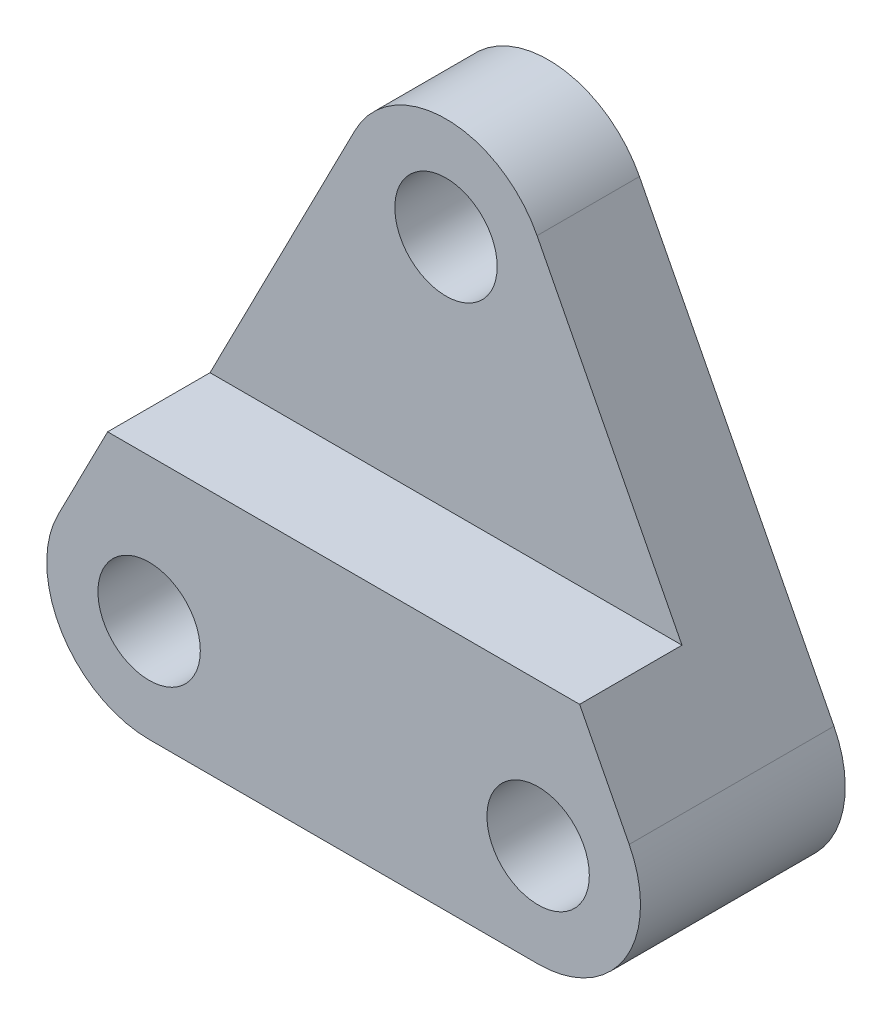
ISO-10303-21;
HEADER;
FILE_DESCRIPTION(('STEP AP214'),'2;1');
FILE_NAME('part.step','',(''),(''),'','','');
FILE_SCHEMA(('AUTOMOTIVE_DESIGN { 1 0 10303 214 1 1 1 1 }'));
ENDSEC;
DATA;
#1=APPLICATION_CONTEXT('core data for automotive mechanical design processes');
#2=APPLICATION_PROTOCOL_DEFINITION('international standard','automotive_design',2000,#1);
#3=PRODUCT_CONTEXT('',#1,'mechanical');
#4=PRODUCT('Part','Part','',(#3));
#5=PRODUCT_RELATED_PRODUCT_CATEGORY('part','',(#4));
#6=PRODUCT_DEFINITION_FORMATION('','',#4);
#7=PRODUCT_DEFINITION_CONTEXT('part definition',#1,'design');
#8=PRODUCT_DEFINITION('design','',#6,#7);
#9=PRODUCT_DEFINITION_SHAPE('','',#8);
#10=(LENGTH_UNIT() NAMED_UNIT(*) SI_UNIT(.MILLI.,.METRE.));
#11=(NAMED_UNIT(*) PLANE_ANGLE_UNIT() SI_UNIT($,.RADIAN.));
#12=(NAMED_UNIT(*) SI_UNIT($,.STERADIAN.) SOLID_ANGLE_UNIT());
#13=UNCERTAINTY_MEASURE_WITH_UNIT(LENGTH_MEASURE(1.E-05),#10,'distance_accuracy_value','');
#14=(GEOMETRIC_REPRESENTATION_CONTEXT(3) GLOBAL_UNCERTAINTY_ASSIGNED_CONTEXT((#13)) GLOBAL_UNIT_ASSIGNED_CONTEXT((#10,
#11,#12)) REPRESENTATION_CONTEXT('',''));
#15=CARTESIAN_POINT('',(0.,0.,0.));
#16=DIRECTION('',(0.,0.,1.));
#17=DIRECTION('',(1.,0.,0.));
#18=AXIS2_PLACEMENT_3D('',#15,#16,#17);
#19=CARTESIAN_POINT('',(0.,0.,10.));
#20=DIRECTION('',(0.,0.,1.));
#21=DIRECTION('',(1.,0.,0.));
#22=AXIS2_PLACEMENT_3D('',#19,#20,#21);
#23=PLANE('',#22);
#24=DIRECTION('',(-1.,0.,0.));
#25=VECTOR('',#24,1.);
#26=CARTESIAN_POINT('',(-23.0522347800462,-23.,10.));
#27=LINE('',#26,#25);
#28=CARTESIAN_POINT('',(23.0522347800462,-23.,10.));
#29=VERTEX_POINT('',#28);
#30=CARTESIAN_POINT('',(-23.0522347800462,-23.,10.));
#31=VERTEX_POINT('',#30);
#32=EDGE_CURVE('E48',#29,#31,#27,.T.);
#33=ORIENTED_EDGE('',*,*,#32,.F.);
#34=DIRECTION('',(-0.456804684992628,0.889567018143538,0.));
#35=VECTOR('',#34,1.);
#36=CARTESIAN_POINT('',(8.89567018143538,4.56804684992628,10.));
#37=LINE('',#36,#35);
#38=CARTESIAN_POINT('',(8.89567018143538,4.56804684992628,10.));
#39=VERTEX_POINT('',#38);
#40=EDGE_CURVE('E53',#29,#39,#37,.T.);
#41=ORIENTED_EDGE('',*,*,#40,.T.);
#42=CARTESIAN_POINT('',(0.,0.,10.));
#43=DIRECTION('',(0.,0.,1.));
#44=DIRECTION('',(1.,0.,0.));
#45=AXIS2_PLACEMENT_3D('',#42,#43,#44);
#46=CIRCLE('',#45,10.);
#47=CARTESIAN_POINT('',(-8.89567018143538,4.56804684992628,10.));
#48=VERTEX_POINT('',#47);
#49=EDGE_CURVE('E90',#39,#48,#46,.T.);
#50=ORIENTED_EDGE('',*,*,#49,.T.);
#51=DIRECTION('',(-0.456804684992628,-0.889567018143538,0.));
#52=VECTOR('',#51,1.);
#53=CARTESIAN_POINT('',(-8.89567018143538,4.56804684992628,10.));
#54=LINE('',#53,#52);
#55=EDGE_CURVE('E126',#48,#31,#54,.T.);
#56=ORIENTED_EDGE('',*,*,#55,.T.);
#57=EDGE_LOOP('',(#33,#41,#50,#56));
#58=FACE_BOUND('',#57,.T.);
#59=CARTESIAN_POINT('',(0.,0.,10.));
#60=DIRECTION('',(0.,0.,1.));
#61=DIRECTION('',(1.,0.,0.));
#62=AXIS2_PLACEMENT_3D('',#59,#60,#61);
#63=CIRCLE('',#62,5.);
#64=CARTESIAN_POINT('',(5.,0.,10.));
#65=VERTEX_POINT('',#64);
#66=EDGE_CURVE('E102',#65,#65,#63,.T.);
#67=ORIENTED_EDGE('',*,*,#66,.F.);
#68=EDGE_LOOP('',(#67));
#69=FACE_BOUND('',#68,.T.);
#70=ADVANCED_FACE('F31',(#58,#69),#23,.T.);
#71=CARTESIAN_POINT('',(0.,0.,0.));
#72=DIRECTION('',(0.,0.,1.));
#73=DIRECTION('',(1.,0.,0.));
#74=AXIS2_PLACEMENT_3D('',#71,#72,#73);
#75=PLANE('',#74);
#76=CARTESIAN_POINT('',(-19.,-37.,0.));
#77=DIRECTION('',(0.,0.,1.));
#78=DIRECTION('',(1.,0.,0.));
#79=AXIS2_PLACEMENT_3D('',#76,#77,#78);
#80=CIRCLE('',#79,5.);
#81=CARTESIAN_POINT('',(-14.,-37.,0.));
#82=VERTEX_POINT('',#81);
#83=EDGE_CURVE('E133',#82,#82,#80,.T.);
#84=ORIENTED_EDGE('',*,*,#83,.T.);
#85=EDGE_LOOP('',(#84));
#86=FACE_BOUND('',#85,.T.);
#87=CARTESIAN_POINT('',(0.,0.,0.));
#88=DIRECTION('',(0.,0.,1.));
#89=DIRECTION('',(1.,0.,0.));
#90=AXIS2_PLACEMENT_3D('',#87,#88,#89);
#91=CIRCLE('',#90,10.);
#92=CARTESIAN_POINT('',(8.89567018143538,4.56804684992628,0.));
#93=VERTEX_POINT('',#92);
#94=CARTESIAN_POINT('',(-8.89567018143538,4.56804684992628,0.));
#95=VERTEX_POINT('',#94);
#96=EDGE_CURVE('E96',#93,#95,#91,.T.);
#97=ORIENTED_EDGE('',*,*,#96,.F.);
#98=DIRECTION('',(-0.456804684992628,0.889567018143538,0.));
#99=VECTOR('',#98,1.);
#100=CARTESIAN_POINT('',(8.89567018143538,4.56804684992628,0.));
#101=LINE('',#100,#99);
#102=CARTESIAN_POINT('',(27.8956701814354,-32.4319531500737,0.));
#103=VERTEX_POINT('',#102);
#104=EDGE_CURVE('E79',#103,#93,#101,.T.);
#105=ORIENTED_EDGE('',*,*,#104,.F.);
#106=CARTESIAN_POINT('',(19.,-37.,0.));
#107=DIRECTION('',(0.,0.,1.));
#108=DIRECTION('',(1.,0.,0.));
#109=AXIS2_PLACEMENT_3D('',#106,#107,#108);
#110=CIRCLE('',#109,10.);
#111=CARTESIAN_POINT('',(19.,-47.,0.));
#112=VERTEX_POINT('',#111);
#113=EDGE_CURVE('E91',#112,#103,#110,.T.);
#114=ORIENTED_EDGE('',*,*,#113,.F.);
#115=DIRECTION('',(1.,0.,0.));
#116=VECTOR('',#115,1.);
#117=CARTESIAN_POINT('',(-19.,-47.,0.));
#118=LINE('',#117,#116);
#119=CARTESIAN_POINT('',(-19.,-47.,0.));
#120=VERTEX_POINT('',#119);
#121=EDGE_CURVE('E114',#120,#112,#118,.T.);
#122=ORIENTED_EDGE('',*,*,#121,.F.);
#123=CARTESIAN_POINT('',(-19.,-37.,0.));
#124=DIRECTION('',(0.,0.,1.));
#125=DIRECTION('',(1.,0.,0.));
#126=AXIS2_PLACEMENT_3D('',#123,#124,#125);
#127=CIRCLE('',#126,10.);
#128=CARTESIAN_POINT('',(-27.8956701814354,-32.4319531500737,0.));
#129=VERTEX_POINT('',#128);
#130=EDGE_CURVE('E104',#129,#120,#127,.T.);
#131=ORIENTED_EDGE('',*,*,#130,.F.);
#132=DIRECTION('',(-0.456804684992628,-0.889567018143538,0.));
#133=VECTOR('',#132,1.);
#134=CARTESIAN_POINT('',(-8.89567018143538,4.56804684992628,0.));
#135=LINE('',#134,#133);
#136=EDGE_CURVE('E101',#95,#129,#135,.T.);
#137=ORIENTED_EDGE('',*,*,#136,.F.);
#138=EDGE_LOOP('',(#97,#105,#114,#122,#131,#137));
#139=FACE_BOUND('',#138,.T.);
#140=CARTESIAN_POINT('',(0.,0.,0.));
#141=DIRECTION('',(0.,0.,1.));
#142=DIRECTION('',(1.,0.,0.));
#143=AXIS2_PLACEMENT_3D('',#140,#141,#142);
#144=CIRCLE('',#143,5.);
#145=CARTESIAN_POINT('',(5.,0.,0.));
#146=VERTEX_POINT('',#145);
#147=EDGE_CURVE('E107',#146,#146,#144,.T.);
#148=ORIENTED_EDGE('',*,*,#147,.T.);
#149=EDGE_LOOP('',(#148));
#150=FACE_BOUND('',#149,.T.);
#151=CARTESIAN_POINT('',(19.,-37.,0.));
#152=DIRECTION('',(0.,0.,1.));
#153=DIRECTION('',(1.,0.,0.));
#154=AXIS2_PLACEMENT_3D('',#151,#152,#153);
#155=CIRCLE('',#154,5.);
#156=CARTESIAN_POINT('',(24.,-37.,0.));
#157=VERTEX_POINT('',#156);
#158=EDGE_CURVE('E137',#157,#157,#155,.T.);
#159=ORIENTED_EDGE('',*,*,#158,.T.);
#160=EDGE_LOOP('',(#159));
#161=FACE_BOUND('',#160,.T.);
#162=ADVANCED_FACE('F98',(#86,#139,#150,#161),#75,.F.);
#163=CARTESIAN_POINT('',(0.,0.,10.));
#164=DIRECTION('',(0.,0.,-1.));
#165=DIRECTION('',(-1.,0.,0.));
#166=AXIS2_PLACEMENT_3D('',#163,#164,#165);
#167=CYLINDRICAL_SURFACE('',#166,10.);
#168=ORIENTED_EDGE('',*,*,#96,.T.);
#169=DIRECTION('',(0.,0.,-1.));
#170=VECTOR('',#169,1.);
#171=CARTESIAN_POINT('',(-8.89567018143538,4.56804684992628,10.));
#172=LINE('',#171,#170);
#173=EDGE_CURVE('E11',#48,#95,#172,.T.);
#174=ORIENTED_EDGE('',*,*,#173,.F.);
#175=ORIENTED_EDGE('',*,*,#49,.F.);
#176=DIRECTION('',(0.,0.,-1.));
#177=VECTOR('',#176,1.);
#178=CARTESIAN_POINT('',(8.89567018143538,4.56804684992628,10.));
#179=LINE('',#178,#177);
#180=EDGE_CURVE('E82',#39,#93,#179,.T.);
#181=ORIENTED_EDGE('',*,*,#180,.T.);
#182=EDGE_LOOP('',(#168,#174,#175,#181));
#183=FACE_BOUND('',#182,.T.);
#184=ADVANCED_FACE('F33',(#183),#167,.T.);
#185=CARTESIAN_POINT('',(-8.89567018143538,4.56804684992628,10.));
#186=DIRECTION('',(0.889567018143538,-0.456804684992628,0.));
#187=DIRECTION('',(0.456804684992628,0.889567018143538,0.));
#188=AXIS2_PLACEMENT_3D('',#185,#186,#187);
#189=PLANE('',#188);
#190=ORIENTED_EDGE('',*,*,#136,.T.);
#191=DIRECTION('',(0.,0.,-1.));
#192=VECTOR('',#191,1.);
#193=CARTESIAN_POINT('',(-27.8956701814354,-32.4319531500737,10.));
#194=LINE('',#193,#192);
#195=CARTESIAN_POINT('',(-27.8956701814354,-32.4319531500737,20.));
#196=VERTEX_POINT('',#195);
#197=EDGE_CURVE('E40',#196,#129,#194,.T.);
#198=ORIENTED_EDGE('',*,*,#197,.F.);
#199=DIRECTION('',(-0.456804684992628,-0.889567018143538,0.));
#200=VECTOR('',#199,1.);
#201=CARTESIAN_POINT('',(-23.0522347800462,-23.,20.));
#202=LINE('',#201,#200);
#203=CARTESIAN_POINT('',(-23.0522347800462,-23.,20.));
#204=VERTEX_POINT('',#203);
#205=EDGE_CURVE('E146',#204,#196,#202,.T.);
#206=ORIENTED_EDGE('',*,*,#205,.F.);
#207=DIRECTION('',(0.,0.,-1.));
#208=VECTOR('',#207,1.);
#209=CARTESIAN_POINT('',(-23.0522347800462,-23.,20.));
#210=LINE('',#209,#208);
#211=EDGE_CURVE('E148',#204,#31,#210,.T.);
#212=ORIENTED_EDGE('',*,*,#211,.T.);
#213=ORIENTED_EDGE('',*,*,#55,.F.);
#214=ORIENTED_EDGE('',*,*,#173,.T.);
#215=EDGE_LOOP('',(#190,#198,#206,#212,#213,#214));
#216=FACE_BOUND('',#215,.T.);
#217=ADVANCED_FACE('F240',(#216),#189,.F.);
#218=CARTESIAN_POINT('',(-19.,-37.,10.));
#219=DIRECTION('',(0.,0.,-1.));
#220=DIRECTION('',(-1.,0.,0.));
#221=AXIS2_PLACEMENT_3D('',#218,#219,#220);
#222=CYLINDRICAL_SURFACE('',#221,10.);
#223=ORIENTED_EDGE('',*,*,#130,.T.);
#224=DIRECTION('',(0.,0.,-1.));
#225=VECTOR('',#224,1.);
#226=CARTESIAN_POINT('',(-19.,-47.,10.));
#227=LINE('',#226,#225);
#228=CARTESIAN_POINT('',(-19.,-47.,20.));
#229=VERTEX_POINT('',#228);
#230=EDGE_CURVE('E121',#229,#120,#227,.T.);
#231=ORIENTED_EDGE('',*,*,#230,.F.);
#232=CARTESIAN_POINT('',(-19.,-37.,20.));
#233=DIRECTION('',(0.,0.,1.));
#234=DIRECTION('',(1.,0.,0.));
#235=AXIS2_PLACEMENT_3D('',#232,#233,#234);
#236=CIRCLE('',#235,10.);
#237=EDGE_CURVE('E194',#196,#229,#236,.T.);
#238=ORIENTED_EDGE('',*,*,#237,.F.);
#239=ORIENTED_EDGE('',*,*,#197,.T.);
#240=EDGE_LOOP('',(#223,#231,#238,#239));
#241=FACE_BOUND('',#240,.T.);
#242=ADVANCED_FACE('F238',(#241),#222,.T.);
#243=CARTESIAN_POINT('',(-19.,-47.,10.));
#244=DIRECTION('',(0.,1.,0.));
#245=DIRECTION('',(0.,0.,1.));
#246=AXIS2_PLACEMENT_3D('',#243,#244,#245);
#247=PLANE('',#246);
#248=ORIENTED_EDGE('',*,*,#121,.T.);
#249=DIRECTION('',(0.,0.,-1.));
#250=VECTOR('',#249,1.);
#251=CARTESIAN_POINT('',(19.,-47.,10.));
#252=LINE('',#251,#250);
#253=CARTESIAN_POINT('',(19.,-47.,20.));
#254=VERTEX_POINT('',#253);
#255=EDGE_CURVE('E118',#254,#112,#252,.T.);
#256=ORIENTED_EDGE('',*,*,#255,.F.);
#257=DIRECTION('',(1.,0.,0.));
#258=VECTOR('',#257,1.);
#259=CARTESIAN_POINT('',(19.,-47.,20.));
#260=LINE('',#259,#258);
#261=EDGE_CURVE('E185',#229,#254,#260,.T.);
#262=ORIENTED_EDGE('',*,*,#261,.F.);
#263=ORIENTED_EDGE('',*,*,#230,.T.);
#264=EDGE_LOOP('',(#248,#256,#262,#263));
#265=FACE_BOUND('',#264,.T.);
#266=ADVANCED_FACE('F184',(#265),#247,.F.);
#267=CARTESIAN_POINT('',(19.,-37.,10.));
#268=DIRECTION('',(0.,0.,-1.));
#269=DIRECTION('',(-1.,0.,0.));
#270=AXIS2_PLACEMENT_3D('',#267,#268,#269);
#271=CYLINDRICAL_SURFACE('',#270,10.);
#272=ORIENTED_EDGE('',*,*,#113,.T.);
#273=DIRECTION('',(0.,0.,-1.));
#274=VECTOR('',#273,1.);
#275=CARTESIAN_POINT('',(27.8956701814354,-32.4319531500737,10.));
#276=LINE('',#275,#274);
#277=CARTESIAN_POINT('',(27.8956701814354,-32.4319531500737,20.));
#278=VERTEX_POINT('',#277);
#279=EDGE_CURVE('E86',#278,#103,#276,.T.);
#280=ORIENTED_EDGE('',*,*,#279,.F.);
#281=CARTESIAN_POINT('',(19.,-37.,20.));
#282=DIRECTION('',(0.,0.,1.));
#283=DIRECTION('',(1.,0.,0.));
#284=AXIS2_PLACEMENT_3D('',#281,#282,#283);
#285=CIRCLE('',#284,10.);
#286=EDGE_CURVE('E193',#254,#278,#285,.T.);
#287=ORIENTED_EDGE('',*,*,#286,.F.);
#288=ORIENTED_EDGE('',*,*,#255,.T.);
#289=EDGE_LOOP('',(#272,#280,#287,#288));
#290=FACE_BOUND('',#289,.T.);
#291=ADVANCED_FACE('F196',(#290),#271,.T.);
#292=CARTESIAN_POINT('',(8.89567018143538,4.56804684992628,10.));
#293=DIRECTION('',(-0.889567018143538,-0.456804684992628,0.));
#294=DIRECTION('',(0.456804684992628,-0.889567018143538,0.));
#295=AXIS2_PLACEMENT_3D('',#292,#293,#294);
#296=PLANE('',#295);
#297=ORIENTED_EDGE('',*,*,#104,.T.);
#298=ORIENTED_EDGE('',*,*,#180,.F.);
#299=ORIENTED_EDGE('',*,*,#40,.F.);
#300=DIRECTION('',(0.,0.,-1.));
#301=VECTOR('',#300,1.);
#302=CARTESIAN_POINT('',(23.0522347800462,-23.,20.));
#303=LINE('',#302,#301);
#304=CARTESIAN_POINT('',(23.0522347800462,-23.,20.));
#305=VERTEX_POINT('',#304);
#306=EDGE_CURVE('E140',#305,#29,#303,.T.);
#307=ORIENTED_EDGE('',*,*,#306,.F.);
#308=DIRECTION('',(-0.456804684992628,0.889567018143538,0.));
#309=VECTOR('',#308,1.);
#310=CARTESIAN_POINT('',(23.0522347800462,-23.,20.));
#311=LINE('',#310,#309);
#312=EDGE_CURVE('E163',#278,#305,#311,.T.);
#313=ORIENTED_EDGE('',*,*,#312,.F.);
#314=ORIENTED_EDGE('',*,*,#279,.T.);
#315=EDGE_LOOP('',(#297,#298,#299,#307,#313,#314));
#316=FACE_BOUND('',#315,.T.);
#317=ADVANCED_FACE('F81',(#316),#296,.F.);
#318=CARTESIAN_POINT('',(0.,0.,10.));
#319=DIRECTION('',(0.,0.,-1.));
#320=DIRECTION('',(-1.,0.,0.));
#321=AXIS2_PLACEMENT_3D('',#318,#319,#320);
#322=CYLINDRICAL_SURFACE('',#321,5.);
#323=ORIENTED_EDGE('',*,*,#66,.T.);
#324=EDGE_LOOP('',(#323));
#325=FACE_BOUND('',#324,.T.);
#326=ORIENTED_EDGE('',*,*,#147,.F.);
#327=EDGE_LOOP('',(#326));
#328=FACE_BOUND('',#327,.T.);
#329=ADVANCED_FACE('F229',(#325,#328),#322,.F.);
#330=CARTESIAN_POINT('',(-19.,-37.,10.));
#331=DIRECTION('',(0.,0.,-1.));
#332=DIRECTION('',(-1.,0.,0.));
#333=AXIS2_PLACEMENT_3D('',#330,#331,#332);
#334=CYLINDRICAL_SURFACE('',#333,5.);
#335=ORIENTED_EDGE('',*,*,#83,.F.);
#336=EDGE_LOOP('',(#335));
#337=FACE_BOUND('',#336,.T.);
#338=CARTESIAN_POINT('',(-19.,-37.,20.));
#339=DIRECTION('',(0.,0.,1.));
#340=DIRECTION('',(1.,0.,0.));
#341=AXIS2_PLACEMENT_3D('',#338,#339,#340);
#342=CIRCLE('',#341,5.);
#343=CARTESIAN_POINT('',(-14.,-37.,20.));
#344=VERTEX_POINT('',#343);
#345=EDGE_CURVE('E203',#344,#344,#342,.T.);
#346=ORIENTED_EDGE('',*,*,#345,.T.);
#347=EDGE_LOOP('',(#346));
#348=FACE_BOUND('',#347,.T.);
#349=ADVANCED_FACE('F207',(#337,#348),#334,.F.);
#350=CARTESIAN_POINT('',(19.,-37.,10.));
#351=DIRECTION('',(0.,0.,-1.));
#352=DIRECTION('',(-1.,0.,0.));
#353=AXIS2_PLACEMENT_3D('',#350,#351,#352);
#354=CYLINDRICAL_SURFACE('',#353,5.);
#355=ORIENTED_EDGE('',*,*,#158,.F.);
#356=EDGE_LOOP('',(#355));
#357=FACE_BOUND('',#356,.T.);
#358=CARTESIAN_POINT('',(19.,-37.,20.));
#359=DIRECTION('',(0.,0.,1.));
#360=DIRECTION('',(1.,0.,0.));
#361=AXIS2_PLACEMENT_3D('',#358,#359,#360);
#362=CIRCLE('',#361,5.);
#363=CARTESIAN_POINT('',(24.,-37.,20.));
#364=VERTEX_POINT('',#363);
#365=EDGE_CURVE('E147',#364,#364,#362,.T.);
#366=ORIENTED_EDGE('',*,*,#365,.T.);
#367=EDGE_LOOP('',(#366));
#368=FACE_BOUND('',#367,.T.);
#369=ADVANCED_FACE('F209',(#357,#368),#354,.F.);
#370=CARTESIAN_POINT('',(-19.,-37.,20.));
#371=DIRECTION('',(0.,0.,1.));
#372=DIRECTION('',(1.,0.,0.));
#373=AXIS2_PLACEMENT_3D('',#370,#371,#372);
#374=PLANE('',#373);
#375=ORIENTED_EDGE('',*,*,#365,.F.);
#376=EDGE_LOOP('',(#375));
#377=FACE_BOUND('',#376,.T.);
#378=ORIENTED_EDGE('',*,*,#205,.T.);
#379=ORIENTED_EDGE('',*,*,#237,.T.);
#380=ORIENTED_EDGE('',*,*,#261,.T.);
#381=ORIENTED_EDGE('',*,*,#286,.T.);
#382=ORIENTED_EDGE('',*,*,#312,.T.);
#383=DIRECTION('',(-1.,0.,0.));
#384=VECTOR('',#383,1.);
#385=CARTESIAN_POINT('',(-23.0522347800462,-23.,20.));
#386=LINE('',#385,#384);
#387=EDGE_CURVE('E143',#305,#204,#386,.T.);
#388=ORIENTED_EDGE('',*,*,#387,.T.);
#389=EDGE_LOOP('',(#378,#379,#380,#381,#382,#388));
#390=FACE_BOUND('',#389,.T.);
#391=ORIENTED_EDGE('',*,*,#345,.F.);
#392=EDGE_LOOP('',(#391));
#393=FACE_BOUND('',#392,.T.);
#394=ADVANCED_FACE('F191',(#377,#390,#393),#374,.T.);
#395=CARTESIAN_POINT('',(-23.0522347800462,-23.,20.));
#396=DIRECTION('',(0.,-1.,0.));
#397=DIRECTION('',(0.,0.,-1.));
#398=AXIS2_PLACEMENT_3D('',#395,#396,#397);
#399=PLANE('',#398);
#400=ORIENTED_EDGE('',*,*,#32,.T.);
#401=ORIENTED_EDGE('',*,*,#211,.F.);
#402=ORIENTED_EDGE('',*,*,#387,.F.);
#403=ORIENTED_EDGE('',*,*,#306,.T.);
#404=EDGE_LOOP('',(#400,#401,#402,#403));
#405=FACE_BOUND('',#404,.T.);
#406=ADVANCED_FACE('F156',(#405),#399,.F.);
#407=CLOSED_SHELL('',(#70,#162,#184,#217,#242,#266,#291,#317,#329,#349,#369,#394,#406));
#408=MANIFOLD_SOLID_BREP('B2',#407);
#409=ADVANCED_BREP_SHAPE_REPRESENTATION('',(#18,#408),#14);
#410=SHAPE_DEFINITION_REPRESENTATION(#9,#409);
ENDSEC;
END-ISO-10303-21;
